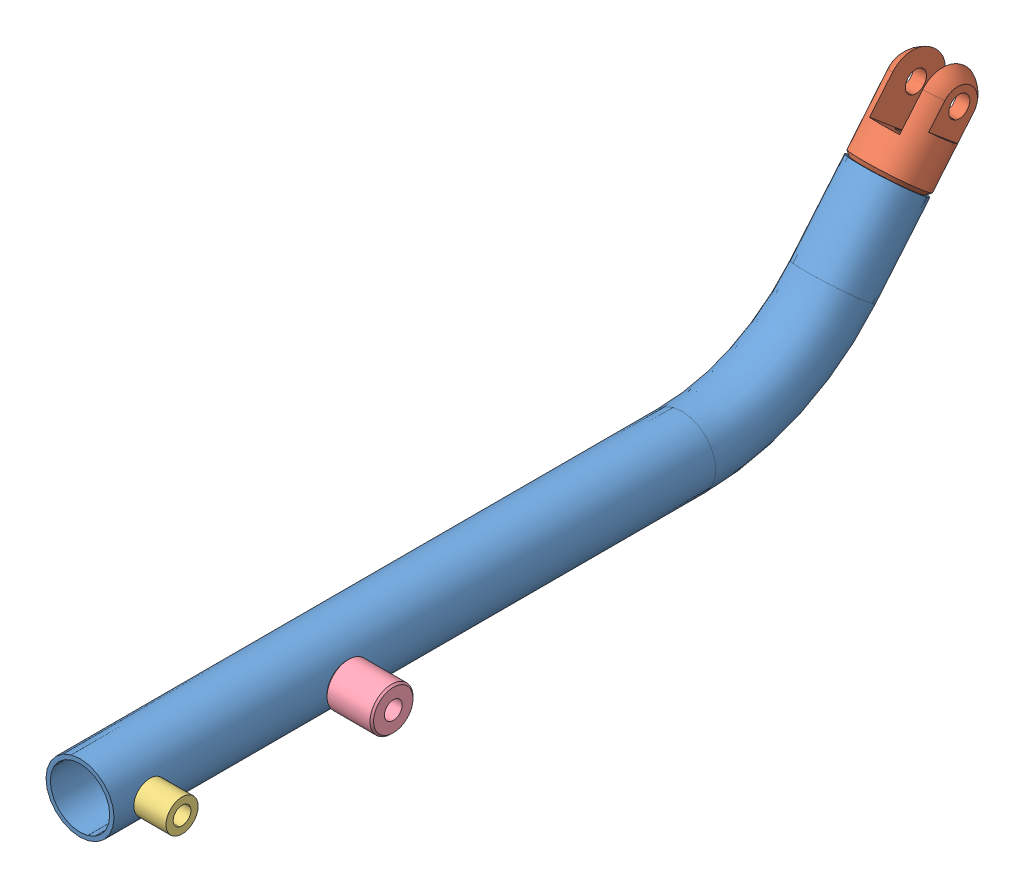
SolidWorks assembly 4633000689_Crurale_Inf_D.sldasm, configuration Défaut (file format 13000). Lengths in mm.
Overall size (32 74.2 250.17).
4 component instances, 4 part files, 0 mates.
Components (placement in the parent):
- 4605000112-2: 4605000112.SLDPRT [Défaut] at origin size (19 53.41 232.73)
- 4635008631-1: 4635008631.sldprt [Défaut] at (0 37.8 -225.45) x (1 0 0) z (0 -0.766044 0.642788) size (19 19 39.14)
- 4627000249-1: 4627000249.sldprt [Défaut] at (13.5 0 -10) x (0 1 0) z (0 0 -1) size (9 10 9)
- 4627000439-1: 4627000439.sldprt [Défaut] at (16 0 -65) x (0 0 1) z (0 1 0) size (12 13 12)
